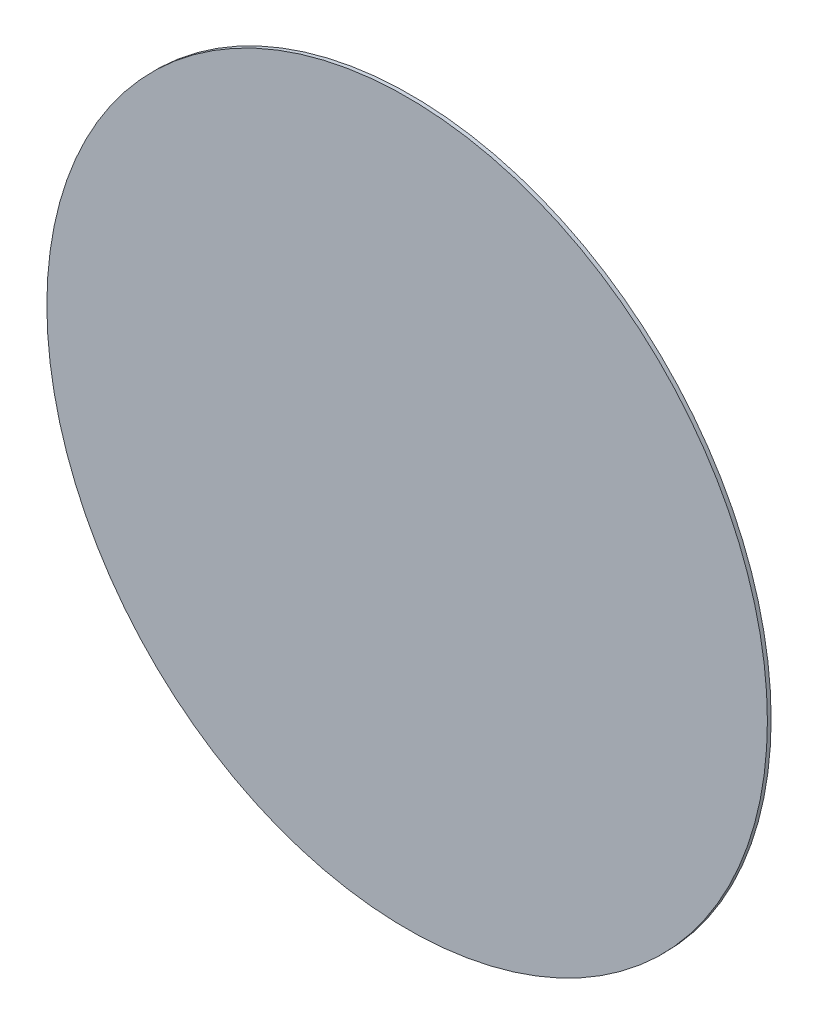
ISO-10303-21;
HEADER;
FILE_DESCRIPTION(('STEP AP214'),'2;1');
FILE_NAME('part.step','',(''),(''),'','','');
FILE_SCHEMA(('AUTOMOTIVE_DESIGN { 1 0 10303 214 1 1 1 1 }'));
ENDSEC;
DATA;
#1=APPLICATION_CONTEXT('core data for automotive mechanical design processes');
#2=APPLICATION_PROTOCOL_DEFINITION('international standard','automotive_design',2000,#1);
#3=PRODUCT_CONTEXT('',#1,'mechanical');
#4=PRODUCT('Part','Part','',(#3));
#5=PRODUCT_RELATED_PRODUCT_CATEGORY('part','',(#4));
#6=PRODUCT_DEFINITION_FORMATION('','',#4);
#7=PRODUCT_DEFINITION_CONTEXT('part definition',#1,'design');
#8=PRODUCT_DEFINITION('design','',#6,#7);
#9=PRODUCT_DEFINITION_SHAPE('','',#8);
#10=(LENGTH_UNIT() NAMED_UNIT(*) SI_UNIT(.MILLI.,.METRE.));
#11=(NAMED_UNIT(*) PLANE_ANGLE_UNIT() SI_UNIT($,.RADIAN.));
#12=(NAMED_UNIT(*) SI_UNIT($,.STERADIAN.) SOLID_ANGLE_UNIT());
#13=UNCERTAINTY_MEASURE_WITH_UNIT(LENGTH_MEASURE(1.E-05),#10,'distance_accuracy_value','');
#14=(GEOMETRIC_REPRESENTATION_CONTEXT(3) GLOBAL_UNCERTAINTY_ASSIGNED_CONTEXT((#13)) GLOBAL_UNIT_ASSIGNED_CONTEXT((#10,
#11,#12)) REPRESENTATION_CONTEXT('',''));
#15=CARTESIAN_POINT('',(0.,0.,0.));
#16=DIRECTION('',(0.,0.,1.));
#17=DIRECTION('',(1.,0.,0.));
#18=AXIS2_PLACEMENT_3D('',#15,#16,#17);
#19=CARTESIAN_POINT('',(0.,0.,0.13));
#20=DIRECTION('',(0.,0.,-1.));
#21=DIRECTION('',(-1.,0.,0.));
#22=AXIS2_PLACEMENT_3D('',#19,#20,#21);
#23=CYLINDRICAL_SURFACE('',#22,12.5);
#24=CARTESIAN_POINT('',(0.,0.,0.13));
#25=DIRECTION('',(0.,0.,1.));
#26=DIRECTION('',(1.,0.,0.));
#27=AXIS2_PLACEMENT_3D('',#24,#25,#26);
#28=CIRCLE('',#27,12.5);
#29=CARTESIAN_POINT('',(12.5,0.,0.13));
#30=VERTEX_POINT('',#29);
#31=EDGE_CURVE('E10',#30,#30,#28,.T.);
#32=ORIENTED_EDGE('',*,*,#31,.F.);
#33=EDGE_LOOP('',(#32));
#34=FACE_BOUND('',#33,.T.);
#35=CARTESIAN_POINT('',(0.,0.,0.));
#36=DIRECTION('',(0.,0.,1.));
#37=DIRECTION('',(1.,0.,0.));
#38=AXIS2_PLACEMENT_3D('',#35,#36,#37);
#39=CIRCLE('',#38,12.5);
#40=CARTESIAN_POINT('',(12.5,0.,0.));
#41=VERTEX_POINT('',#40);
#42=EDGE_CURVE('E34',#41,#41,#39,.T.);
#43=ORIENTED_EDGE('',*,*,#42,.T.);
#44=EDGE_LOOP('',(#43));
#45=FACE_BOUND('',#44,.T.);
#46=ADVANCED_FACE('F31',(#34,#45),#23,.T.);
#47=CARTESIAN_POINT('',(0.,0.,0.13));
#48=DIRECTION('',(0.,0.,1.));
#49=DIRECTION('',(1.,0.,0.));
#50=AXIS2_PLACEMENT_3D('',#47,#48,#49);
#51=PLANE('',#50);
#52=ORIENTED_EDGE('',*,*,#31,.T.);
#53=EDGE_LOOP('',(#52));
#54=FACE_BOUND('',#53,.T.);
#55=ADVANCED_FACE('F46',(#54),#51,.T.);
#56=CARTESIAN_POINT('',(0.,0.,0.));
#57=DIRECTION('',(0.,0.,1.));
#58=DIRECTION('',(1.,0.,0.));
#59=AXIS2_PLACEMENT_3D('',#56,#57,#58);
#60=PLANE('',#59);
#61=ORIENTED_EDGE('',*,*,#42,.F.);
#62=EDGE_LOOP('',(#61));
#63=FACE_BOUND('',#62,.T.);
#64=ADVANCED_FACE('F44',(#63),#60,.F.);
#65=CLOSED_SHELL('',(#46,#55,#64));
#66=MANIFOLD_SOLID_BREP('B2',#65);
#67=ADVANCED_BREP_SHAPE_REPRESENTATION('',(#18,#66),#14);
#68=SHAPE_DEFINITION_REPRESENTATION(#9,#67);
ENDSEC;
END-ISO-10303-21;
